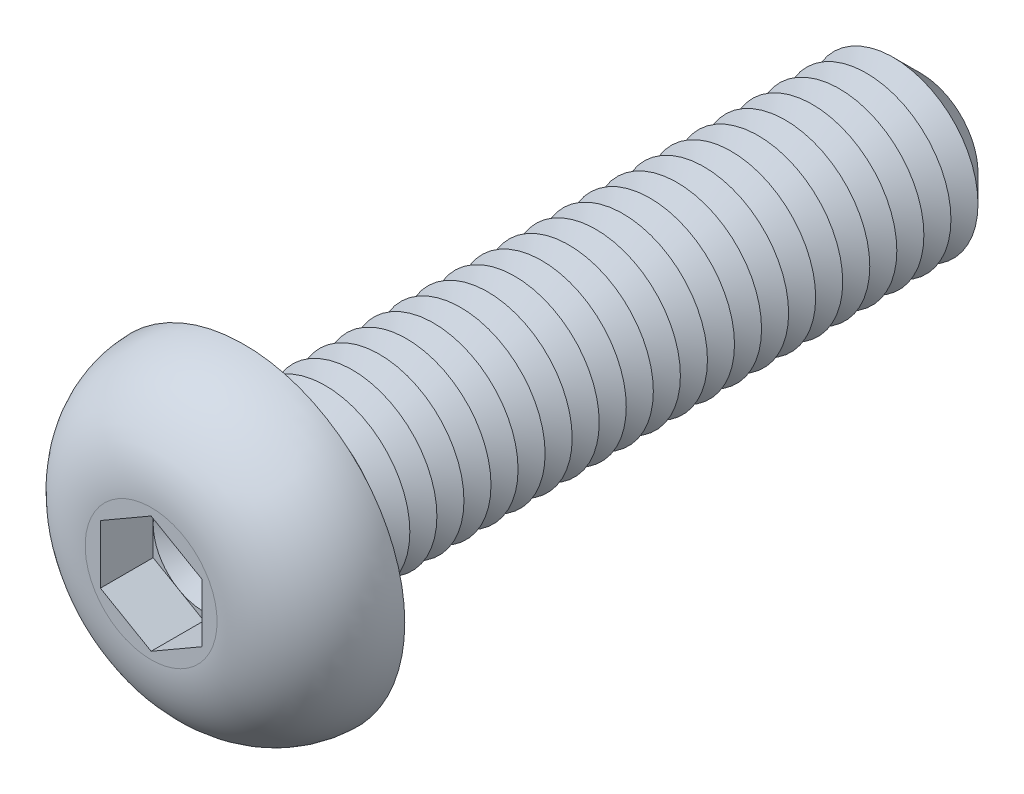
from build123d import *

# Parameters (mm, degrees)
CUT_EXTRUDE1_DEPTH  = 1.56
SKETCH4_R           = 2.5
BOSS_EXTRUDE1_DEPTH = 20
CHAMFER1_SIZE       = 0.8
LPATTERN1_COUNT     = 23
LPATTERN1_PITCH     = 0.8
FILLET2_R           = 0.4


with BuildPart() as part:
    # Sketch2 → Revolve1 (revolve)
    with BuildSketch(Plane(origin=(0, 0, 0), x_dir=(0, 0, -1), z_dir=(1, 0, 0)), mode=Mode.PRIVATE) as revolve1_sk:
        with BuildLine():
            Line((0, 0), (-2.75, 0))
            Line((-2.75, 0), (-2.75, 1.950446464))
            ThreePointArc((-2.75, 1.950446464), (-1.947498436, 3.912588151), (0, 4.75))
            Line((0, 4.75), (0, 0))
        make_face()
    revolve(revolve1_sk.sketch.rotate(Axis((0, 0, 47.934239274), (0, 0, -1)), 90), axis=Axis((0, 0, 47.934239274), (0, 0, -1)))

    # Sketch3 → Cut-Extrude1 (cut)
    with BuildSketch(Plane.XY.offset(2.75)):
        Polygon((0, 1.732050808), (-1.5, 0.866025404), (-1.5, -0.866025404), (0, -1.732050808), (1.5, -0.866025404), (1.5, 0.866025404), align=None)
    extrude(amount=-CUT_EXTRUDE1_DEPTH, mode=Mode.SUBTRACT)

    # Sketch4 → Boss-Extrude1 (add)
    with BuildSketch(Plane(origin=(0, 0, 0), x_dir=(-1, 0, 0), z_dir=(0, 0, -1))):
        with Locations(Location((0, 0, 0), (0, 0, 180))):
            Circle(SKETCH4_R)
    extrude(amount=BOSS_EXTRUDE1_DEPTH)

    # Chamfer1
    chamfer1_edges = [part.edges().sort_by_distance(p)[0] for p in [
        (-2.5, 0, -20),
    ]]
    chamfer(chamfer1_edges, length=CHAMFER1_SIZE)

    # Sketch5 → Cut-Revolve1 (revolve, cut)
    with BuildSketch(Plane(origin=(0, 0, 0), x_dir=(0, 0, -1), z_dir=(1, 0, 0)), mode=Mode.PRIVATE) as cut_revolve1_sk:
        Polygon((0.8, 2.5), (1.6, 2.5), (1.2, 1.807179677), align=None)
    cut_revolve1 = revolve(cut_revolve1_sk.sketch.rotate(Axis((0, 0, 47.934239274), (0, 0, -1)), 90), axis=Axis((0, 0, 47.934239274), (0, 0, -1)), mode=Mode.SUBTRACT)

    # LPattern1: Cut-Revolve1 ×23
    with Locations(*[(0, 0, -i * LPATTERN1_PITCH) for i in range(1, LPATTERN1_COUNT)]):
        add(cut_revolve1, mode=Mode.SUBTRACT)

    # Fillet2
    fillet2_edges = [part.edges().sort_by_distance(p)[0] for p in [
        (-2.5, 0, 0),
    ]]
    fillet(fillet2_edges, radius=FILLET2_R)

    # Cut-Extrude2 cone 1 section (on through the dimple's axis) → Cut-Extrude2 (revolve, cut)
    with BuildSketch(Plane(origin=(0, 0, 1.19), x_dir=(0, -1, 0), z_dir=(1, 0, 0))):
        Polygon((0, 0), (1.5, 0), (0, 0.866025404), align=None)
    revolve(axis=Axis((0, 0, 1.19), (0, 0, -1)), mode=Mode.SUBTRACT)


solid = part.part
